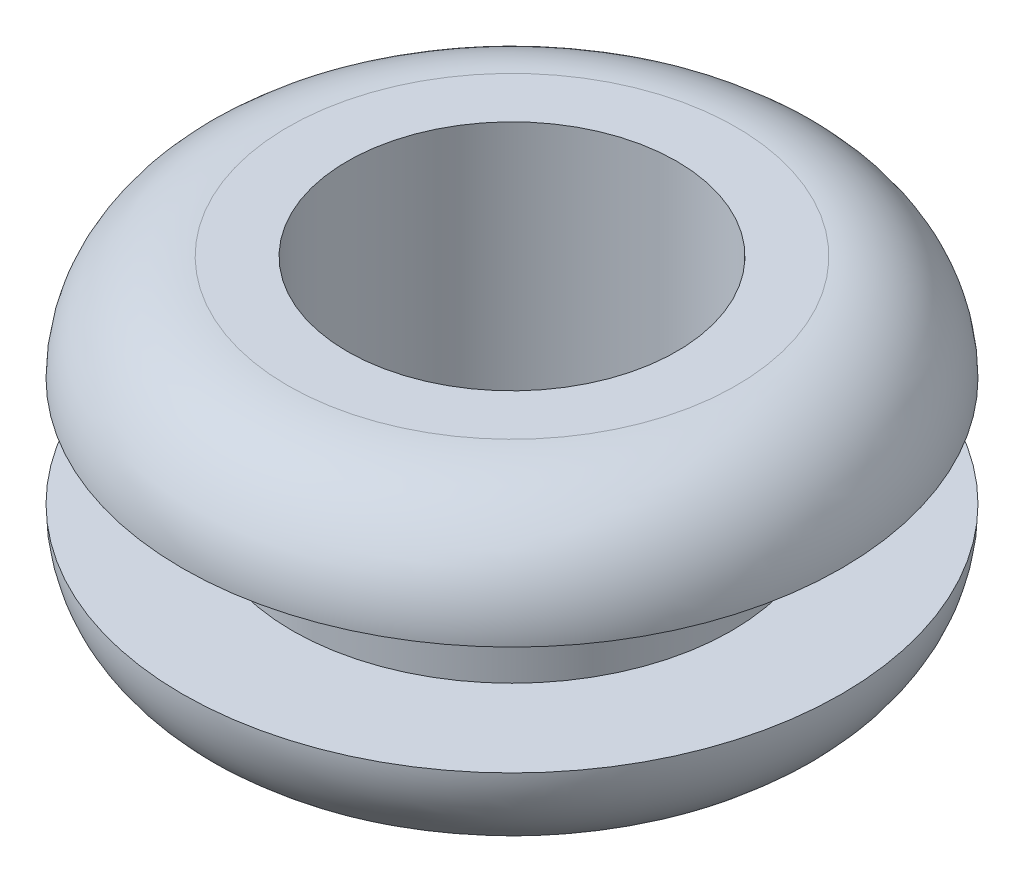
from build123d import *

# Parameters (mm, degrees)
SKETCH1_W          = 4.7625
SKETCH1_H          = 4.6228
FILLET1_R          = 1.524
SKETCH2_W          = 1.5875
SKETCH2_H          = 1.5748
SKETCH3_R          = 2.38125
CUT_EXTRUDE1_DEPTH = 9.169032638


with BuildPart() as part:
    # Sketch1 → Revolve1 (revolve)
    with BuildSketch(Plane(origin=(0, 0, 0), x_dir=(0, 0, -1), z_dir=(1, 0, 0))):
        with Locations((2.38125, 0)):
            Rectangle(SKETCH1_W, SKETCH1_H)
    revolve(axis=Axis((0, 0, 0), (0, 1, 0)))

    # Fillet1
    fillet1_edges = [part.edges().sort_by_distance(p)[0] for p in [
        (0, 2.3114, 4.7625),
        (0, -2.3114, 4.7625),
    ]]
    fillet(fillet1_edges, radius=FILLET1_R)

    # Sketch2 → Cut-Revolve1 (revolve, cut)
    with BuildSketch(Plane(origin=(0, 0, 0), x_dir=(0, 0, -1), z_dir=(1, 0, 0))):
        with Locations((3.96875, 0)):
            Rectangle(SKETCH2_W, SKETCH2_H)
    revolve(axis=Axis((0, 0, 0), (0, 1, 0)), mode=Mode.SUBTRACT)

    # Sketch3 → Cut-Extrude1 (cut, through all)
    with BuildSketch(Plane(origin=(0, 2.3114, 0), x_dir=(1, 0, 0), z_dir=(0, 1, 0))):
        with Locations(Location((0, 0, 0), (0, 0, 270))):
            Circle(SKETCH3_R)
    extrude(amount=-CUT_EXTRUDE1_DEPTH, mode=Mode.SUBTRACT)


solid = part.part
